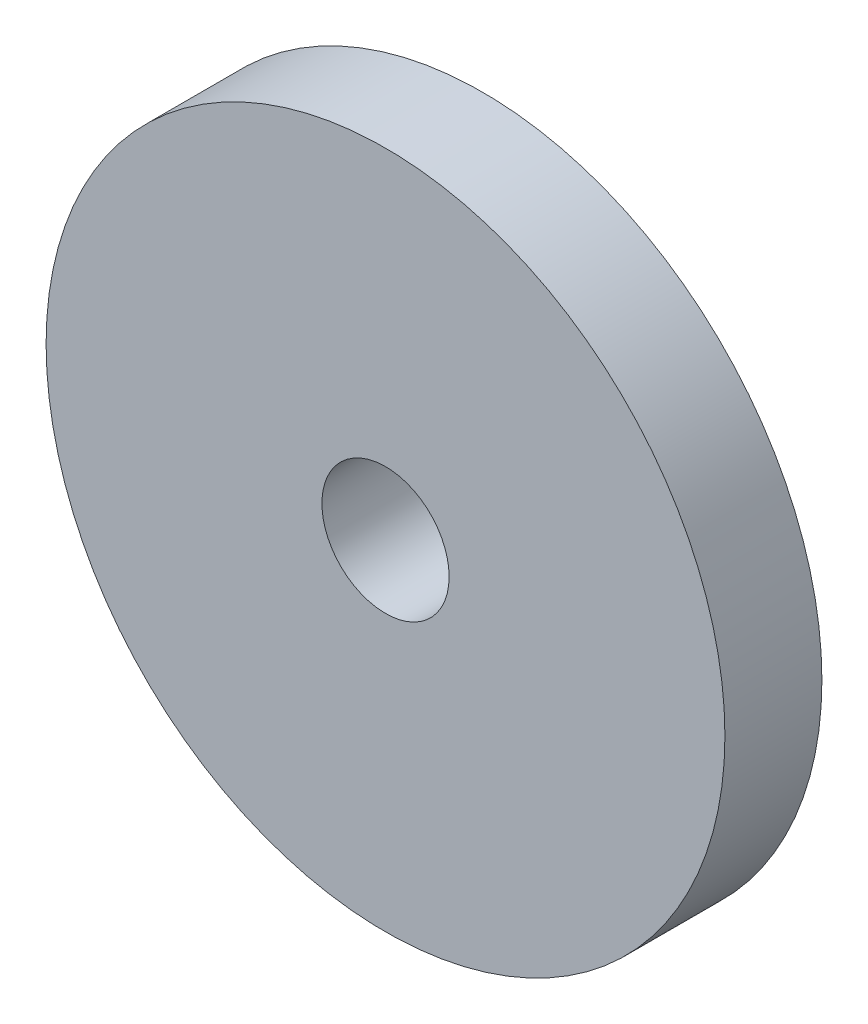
from build123d import *

# Parameters (mm, degrees)
SKETCH1_R           = 11.1125
BOSS_EXTRUDE1_DEPTH = 3.175
SKETCH2_R           = 2.0828
CUT_EXTRUDE1_DEPTH  = 17.03296409


with BuildPart() as part:
    # Sketch1 → Boss-Extrude1 (new body)
    with BuildSketch(Plane.XY):
        Circle(SKETCH1_R)
    extrude(amount=BOSS_EXTRUDE1_DEPTH)

    # Sketch2 → Cut-Extrude1 (cut, through all)
    with BuildSketch(Plane.XY.offset(3.175)):
        Circle(SKETCH2_R)
    extrude(amount=-CUT_EXTRUDE1_DEPTH, mode=Mode.SUBTRACT)


solid = part.part
